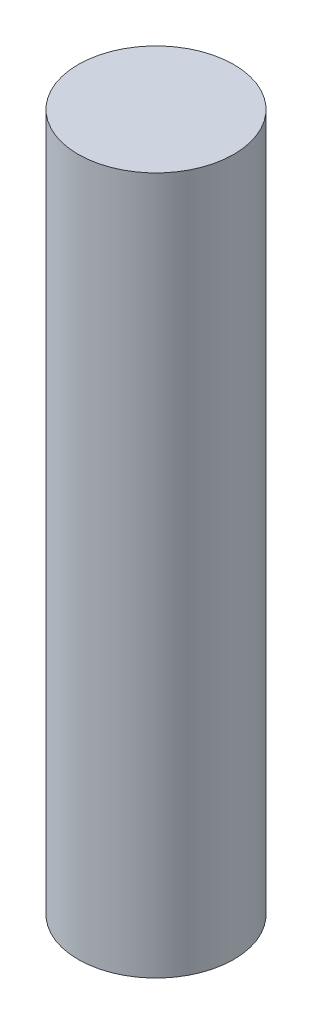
ISO-10303-21;
HEADER;
FILE_DESCRIPTION(('STEP AP214'),'2;1');
FILE_NAME('part.step','',(''),(''),'','','');
FILE_SCHEMA(('AUTOMOTIVE_DESIGN { 1 0 10303 214 1 1 1 1 }'));
ENDSEC;
DATA;
#1=APPLICATION_CONTEXT('core data for automotive mechanical design processes');
#2=APPLICATION_PROTOCOL_DEFINITION('international standard','automotive_design',2000,#1);
#3=PRODUCT_CONTEXT('',#1,'mechanical');
#4=PRODUCT('Part','Part','',(#3));
#5=PRODUCT_RELATED_PRODUCT_CATEGORY('part','',(#4));
#6=PRODUCT_DEFINITION_FORMATION('','',#4);
#7=PRODUCT_DEFINITION_CONTEXT('part definition',#1,'design');
#8=PRODUCT_DEFINITION('design','',#6,#7);
#9=PRODUCT_DEFINITION_SHAPE('','',#8);
#10=(LENGTH_UNIT() NAMED_UNIT(*) SI_UNIT(.MILLI.,.METRE.));
#11=(NAMED_UNIT(*) PLANE_ANGLE_UNIT() SI_UNIT($,.RADIAN.));
#12=(NAMED_UNIT(*) SI_UNIT($,.STERADIAN.) SOLID_ANGLE_UNIT());
#13=UNCERTAINTY_MEASURE_WITH_UNIT(LENGTH_MEASURE(1.E-05),#10,'distance_accuracy_value','');
#14=(GEOMETRIC_REPRESENTATION_CONTEXT(3) GLOBAL_UNCERTAINTY_ASSIGNED_CONTEXT((#13)) GLOBAL_UNIT_ASSIGNED_CONTEXT((#10,
#11,#12)) REPRESENTATION_CONTEXT('',''));
#15=CARTESIAN_POINT('',(0.,0.,0.));
#16=DIRECTION('',(0.,0.,1.));
#17=DIRECTION('',(1.,0.,0.));
#18=AXIS2_PLACEMENT_3D('',#15,#16,#17);
#19=CARTESIAN_POINT('',(0.,7.112,0.));
#20=DIRECTION('',(0.,-1.,0.));
#21=DIRECTION('',(0.,0.,-1.));
#22=AXIS2_PLACEMENT_3D('',#19,#20,#21);
#23=CYLINDRICAL_SURFACE('',#22,0.79375);
#24=CARTESIAN_POINT('',(0.,7.112,0.));
#25=DIRECTION('',(0.,1.,0.));
#26=DIRECTION('',(0.,0.,1.));
#27=AXIS2_PLACEMENT_3D('',#24,#25,#26);
#28=CIRCLE('',#27,0.79375);
#29=CARTESIAN_POINT('',(0.,7.112,0.79375));
#30=VERTEX_POINT('',#29);
#31=EDGE_CURVE('E10',#30,#30,#28,.T.);
#32=ORIENTED_EDGE('',*,*,#31,.F.);
#33=EDGE_LOOP('',(#32));
#34=FACE_BOUND('',#33,.T.);
#35=CARTESIAN_POINT('',(0.,0.,0.));
#36=DIRECTION('',(0.,1.,0.));
#37=DIRECTION('',(0.,0.,1.));
#38=AXIS2_PLACEMENT_3D('',#35,#36,#37);
#39=CIRCLE('',#38,0.79375);
#40=CARTESIAN_POINT('',(0.,0.,0.79375));
#41=VERTEX_POINT('',#40);
#42=EDGE_CURVE('E46',#41,#41,#39,.T.);
#43=ORIENTED_EDGE('',*,*,#42,.T.);
#44=EDGE_LOOP('',(#43));
#45=FACE_BOUND('',#44,.T.);
#46=ADVANCED_FACE('F43',(#34,#45),#23,.T.);
#47=CARTESIAN_POINT('',(0.,7.112,0.));
#48=DIRECTION('',(0.,1.,0.));
#49=DIRECTION('',(0.,0.,1.));
#50=AXIS2_PLACEMENT_3D('',#47,#48,#49);
#51=PLANE('',#50);
#52=ORIENTED_EDGE('',*,*,#31,.T.);
#53=EDGE_LOOP('',(#52));
#54=FACE_BOUND('',#53,.T.);
#55=ADVANCED_FACE('F60',(#54),#51,.T.);
#56=CARTESIAN_POINT('',(0.,0.,0.));
#57=DIRECTION('',(0.,1.,0.));
#58=DIRECTION('',(0.,0.,1.));
#59=AXIS2_PLACEMENT_3D('',#56,#57,#58);
#60=PLANE('',#59);
#61=ORIENTED_EDGE('',*,*,#42,.F.);
#62=EDGE_LOOP('',(#61));
#63=FACE_BOUND('',#62,.T.);
#64=ADVANCED_FACE('F58',(#63),#60,.F.);
#65=CLOSED_SHELL('',(#46,#55,#64));
#66=MANIFOLD_SOLID_BREP('B2',#65);
#67=ADVANCED_BREP_SHAPE_REPRESENTATION('',(#18,#66),#14);
#68=SHAPE_DEFINITION_REPRESENTATION(#9,#67);
ENDSEC;
END-ISO-10303-21;
